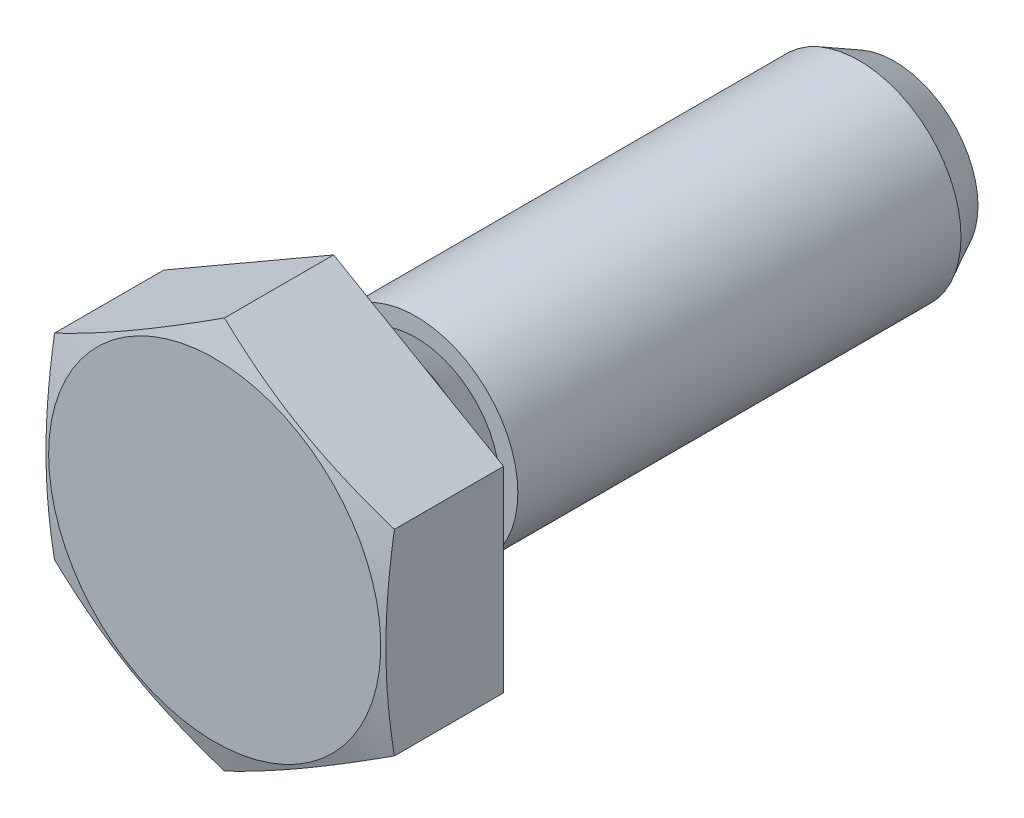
ISO-10303-21;
HEADER;
FILE_DESCRIPTION(('STEP AP214'),'2;1');
FILE_NAME('part.step','',(''),(''),'','','');
FILE_SCHEMA(('AUTOMOTIVE_DESIGN { 1 0 10303 214 1 1 1 1 }'));
ENDSEC;
DATA;
#1=APPLICATION_CONTEXT('core data for automotive mechanical design processes');
#2=APPLICATION_PROTOCOL_DEFINITION('international standard','automotive_design',2000,#1);
#3=PRODUCT_CONTEXT('',#1,'mechanical');
#4=PRODUCT('Part','Part','',(#3));
#5=PRODUCT_RELATED_PRODUCT_CATEGORY('part','',(#4));
#6=PRODUCT_DEFINITION_FORMATION('','',#4);
#7=PRODUCT_DEFINITION_CONTEXT('part definition',#1,'design');
#8=PRODUCT_DEFINITION('design','',#6,#7);
#9=PRODUCT_DEFINITION_SHAPE('','',#8);
#10=(LENGTH_UNIT() NAMED_UNIT(*) SI_UNIT(.MILLI.,.METRE.));
#11=(NAMED_UNIT(*) PLANE_ANGLE_UNIT() SI_UNIT($,.RADIAN.));
#12=(NAMED_UNIT(*) SI_UNIT($,.STERADIAN.) SOLID_ANGLE_UNIT());
#13=UNCERTAINTY_MEASURE_WITH_UNIT(LENGTH_MEASURE(1.E-05),#10,'distance_accuracy_value','');
#14=(GEOMETRIC_REPRESENTATION_CONTEXT(3) GLOBAL_UNCERTAINTY_ASSIGNED_CONTEXT((#13)) GLOBAL_UNIT_ASSIGNED_CONTEXT((#10,
#11,#12)) REPRESENTATION_CONTEXT('',''));
#15=CARTESIAN_POINT('',(0.,0.,0.));
#16=DIRECTION('',(0.,0.,1.));
#17=DIRECTION('',(1.,0.,0.));
#18=AXIS2_PLACEMENT_3D('',#15,#16,#17);
#19=CARTESIAN_POINT('',(0.,0.,0.5));
#20=DIRECTION('',(0.,0.,1.));
#21=DIRECTION('',(1.,0.,0.));
#22=AXIS2_PLACEMENT_3D('',#19,#20,#21);
#23=TOROIDAL_SURFACE('',#22,3.94,0.5);
#24=CARTESIAN_POINT('',(0.,0.,0.5));
#25=DIRECTION('',(0.,0.,1.));
#26=DIRECTION('',(1.,0.,0.));
#27=AXIS2_PLACEMENT_3D('',#24,#25,#26);
#28=CIRCLE('',#27,4.44);
#29=CARTESIAN_POINT('',(4.44,0.,0.5));
#30=VERTEX_POINT('',#29);
#31=EDGE_CURVE('E10',#30,#30,#28,.T.);
#32=ORIENTED_EDGE('',*,*,#31,.F.);
#33=EDGE_LOOP('',(#32));
#34=FACE_BOUND('',#33,.T.);
#35=CARTESIAN_POINT('',(0.,0.,0.));
#36=DIRECTION('',(0.,0.,1.));
#37=DIRECTION('',(1.,0.,0.));
#38=AXIS2_PLACEMENT_3D('',#35,#36,#37);
#39=CIRCLE('',#38,3.94);
#40=CARTESIAN_POINT('',(3.94,0.,0.));
#41=VERTEX_POINT('',#40);
#42=EDGE_CURVE('E22',#41,#41,#39,.T.);
#43=ORIENTED_EDGE('',*,*,#42,.T.);
#44=EDGE_LOOP('',(#43));
#45=FACE_BOUND('',#44,.T.);
#46=ADVANCED_FACE('F15',(#34,#45),#23,.T.);
#47=CARTESIAN_POINT('',(0.,3.94,0.));
#48=DIRECTION('',(0.,0.,-1.));
#49=DIRECTION('',(-1.,0.,0.));
#50=AXIS2_PLACEMENT_3D('',#47,#48,#49);
#51=PLANE('',#50);
#52=CARTESIAN_POINT('',(0.,0.,0.));
#53=DIRECTION('',(0.,0.,1.));
#54=DIRECTION('',(1.,0.,0.));
#55=AXIS2_PLACEMENT_3D('',#52,#53,#54);
#56=CIRCLE('',#55,3.3);
#57=CARTESIAN_POINT('',(3.3,0.,0.));
#58=VERTEX_POINT('',#57);
#59=EDGE_CURVE('E116',#58,#58,#56,.T.);
#60=ORIENTED_EDGE('',*,*,#59,.T.);
#61=EDGE_LOOP('',(#60));
#62=FACE_BOUND('',#61,.T.);
#63=ORIENTED_EDGE('',*,*,#42,.F.);
#64=EDGE_LOOP('',(#63));
#65=FACE_BOUND('',#64,.T.);
#66=ADVANCED_FACE('F122',(#62,#65),#51,.T.);
#67=CARTESIAN_POINT('',(0.,0.,-0.3));
#68=DIRECTION('',(0.,0.,1.));
#69=DIRECTION('',(1.,0.,0.));
#70=AXIS2_PLACEMENT_3D('',#67,#68,#69);
#71=TOROIDAL_SURFACE('',#70,3.3,0.3);
#72=CARTESIAN_POINT('',(0.,0.,-0.3));
#73=DIRECTION('',(0.,0.,1.));
#74=DIRECTION('',(1.,0.,0.));
#75=AXIS2_PLACEMENT_3D('',#72,#73,#74);
#76=CIRCLE('',#75,3.);
#77=CARTESIAN_POINT('',(3.,0.,-0.3));
#78=VERTEX_POINT('',#77);
#79=EDGE_CURVE('E113',#78,#78,#76,.T.);
#80=ORIENTED_EDGE('',*,*,#79,.T.);
#81=EDGE_LOOP('',(#80));
#82=FACE_BOUND('',#81,.T.);
#83=ORIENTED_EDGE('',*,*,#59,.F.);
#84=EDGE_LOOP('',(#83));
#85=FACE_BOUND('',#84,.T.);
#86=ADVANCED_FACE('F124',(#82,#85),#71,.F.);
#87=CARTESIAN_POINT('',(0.,0.,0.5));
#88=DIRECTION('',(0.,0.,1.));
#89=DIRECTION('',(1.,0.,0.));
#90=AXIS2_PLACEMENT_3D('',#87,#88,#89);
#91=CYLINDRICAL_SURFACE('',#90,3.);
#92=CARTESIAN_POINT('',(0.,0.,-0.982527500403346));
#93=DIRECTION('',(0.,0.,1.));
#94=DIRECTION('',(1.,0.,0.));
#95=AXIS2_PLACEMENT_3D('',#92,#93,#94);
#96=CIRCLE('',#95,3.);
#97=CARTESIAN_POINT('',(3.,0.,-0.982527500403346));
#98=VERTEX_POINT('',#97);
#99=EDGE_CURVE('E110',#98,#98,#96,.T.);
#100=ORIENTED_EDGE('',*,*,#99,.T.);
#101=EDGE_LOOP('',(#100));
#102=FACE_BOUND('',#101,.T.);
#103=ORIENTED_EDGE('',*,*,#79,.F.);
#104=EDGE_LOOP('',(#103));
#105=FACE_BOUND('',#104,.T.);
#106=ADVANCED_FACE('F131',(#102,#105),#91,.T.);
#107=CARTESIAN_POINT('',(0.,0.,-0.982527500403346));
#108=DIRECTION('',(0.,0.,1.));
#109=DIRECTION('',(1.,0.,0.));
#110=AXIS2_PLACEMENT_3D('',#107,#108,#109);
#111=CONICAL_SURFACE('',#110,3.,0.523598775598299);
#112=CARTESIAN_POINT('',(0.,0.,-1.92));
#113=DIRECTION('',(0.,0.,1.));
#114=DIRECTION('',(1.,0.,0.));
#115=AXIS2_PLACEMENT_3D('',#112,#113,#114);
#116=CIRCLE('',#115,2.45875);
#117=CARTESIAN_POINT('',(2.45875,0.,-1.92));
#118=VERTEX_POINT('',#117);
#119=EDGE_CURVE('E107',#118,#118,#116,.T.);
#120=ORIENTED_EDGE('',*,*,#119,.T.);
#121=EDGE_LOOP('',(#120));
#122=FACE_BOUND('',#121,.T.);
#123=ORIENTED_EDGE('',*,*,#99,.F.);
#124=EDGE_LOOP('',(#123));
#125=FACE_BOUND('',#124,.T.);
#126=ADVANCED_FACE('F138',(#122,#125),#111,.T.);
#127=CARTESIAN_POINT('',(0.,2.45875,-1.92));
#128=DIRECTION('',(0.,0.,1.));
#129=DIRECTION('',(1.,0.,0.));
#130=AXIS2_PLACEMENT_3D('',#127,#128,#129);
#131=PLANE('',#130);
#132=CARTESIAN_POINT('',(0.,0.,-1.92));
#133=DIRECTION('',(0.,0.,1.));
#134=DIRECTION('',(1.,0.,0.));
#135=AXIS2_PLACEMENT_3D('',#132,#133,#134);
#136=CIRCLE('',#135,3.);
#137=CARTESIAN_POINT('',(3.,0.,-1.92));
#138=VERTEX_POINT('',#137);
#139=EDGE_CURVE('E104',#138,#138,#136,.T.);
#140=ORIENTED_EDGE('',*,*,#139,.T.);
#141=EDGE_LOOP('',(#140));
#142=FACE_BOUND('',#141,.T.);
#143=ORIENTED_EDGE('',*,*,#119,.F.);
#144=EDGE_LOOP('',(#143));
#145=FACE_BOUND('',#144,.T.);
#146=ADVANCED_FACE('F142',(#142,#145),#131,.T.);
#147=CARTESIAN_POINT('',(0.,0.,0.5));
#148=DIRECTION('',(0.,0.,1.));
#149=DIRECTION('',(1.,0.,0.));
#150=AXIS2_PLACEMENT_3D('',#147,#148,#149);
#151=CYLINDRICAL_SURFACE('',#150,3.);
#152=CARTESIAN_POINT('',(0.,0.,-14.95875));
#153=DIRECTION('',(0.,0.,1.));
#154=DIRECTION('',(1.,0.,0.));
#155=AXIS2_PLACEMENT_3D('',#152,#153,#154);
#156=CIRCLE('',#155,3.);
#157=CARTESIAN_POINT('',(3.,0.,-14.95875));
#158=VERTEX_POINT('',#157);
#159=EDGE_CURVE('E101',#158,#158,#156,.T.);
#160=ORIENTED_EDGE('',*,*,#159,.T.);
#161=EDGE_LOOP('',(#160));
#162=FACE_BOUND('',#161,.T.);
#163=ORIENTED_EDGE('',*,*,#139,.F.);
#164=EDGE_LOOP('',(#163));
#165=FACE_BOUND('',#164,.T.);
#166=ADVANCED_FACE('F146',(#162,#165),#151,.T.);
#167=CARTESIAN_POINT('',(0.,0.,-14.95875));
#168=DIRECTION('',(0.,0.,1.));
#169=DIRECTION('',(1.,0.,0.));
#170=AXIS2_PLACEMENT_3D('',#167,#168,#169);
#171=CONICAL_SURFACE('',#170,3.,0.479368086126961);
#172=CARTESIAN_POINT('',(0.,0.,-16.));
#173=DIRECTION('',(0.,0.,1.));
#174=DIRECTION('',(1.,0.,0.));
#175=AXIS2_PLACEMENT_3D('',#172,#173,#174);
#176=CIRCLE('',#175,2.45875);
#177=CARTESIAN_POINT('',(2.45875,0.,-16.));
#178=VERTEX_POINT('',#177);
#179=EDGE_CURVE('E98',#178,#178,#176,.T.);
#180=ORIENTED_EDGE('',*,*,#179,.T.);
#181=EDGE_LOOP('',(#180));
#182=FACE_BOUND('',#181,.T.);
#183=ORIENTED_EDGE('',*,*,#159,.F.);
#184=EDGE_LOOP('',(#183));
#185=FACE_BOUND('',#184,.T.);
#186=ADVANCED_FACE('F150',(#182,#185),#171,.T.);
#187=CARTESIAN_POINT('',(0.,2.45875,-16.));
#188=DIRECTION('',(0.,0.,-1.));
#189=DIRECTION('',(-1.,0.,0.));
#190=AXIS2_PLACEMENT_3D('',#187,#188,#189);
#191=PLANE('',#190);
#192=ORIENTED_EDGE('',*,*,#179,.F.);
#193=EDGE_LOOP('',(#192));
#194=FACE_BOUND('',#193,.T.);
#195=ADVANCED_FACE('F154',(#194),#191,.T.);
#196=CARTESIAN_POINT('',(-5.,-2.88675,0.5));
#197=DIRECTION('',(0.,0.,-1.));
#198=DIRECTION('',(-1.,0.,0.));
#199=AXIS2_PLACEMENT_3D('',#196,#197,#198);
#200=PLANE('',#199);
#201=DIRECTION('',(0.,-1.,0.));
#202=VECTOR('',#201,1.);
#203=CARTESIAN_POINT('',(-5.,2.88675,0.5));
#204=LINE('',#203,#202);
#205=CARTESIAN_POINT('',(-5.,2.88675,0.5));
#206=VERTEX_POINT('',#205);
#207=CARTESIAN_POINT('',(-5.,-2.88675,0.5));
#208=VERTEX_POINT('',#207);
#209=EDGE_CURVE('E81',#206,#208,#204,.T.);
#210=ORIENTED_EDGE('',*,*,#209,.F.);
#211=DIRECTION('',(0.866025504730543,0.499999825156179,0.));
#212=VECTOR('',#211,1.);
#213=CARTESIAN_POINT('',(-5.,2.88675,0.5));
#214=LINE('',#213,#212);
#215=CARTESIAN_POINT('',(0.,5.7735,0.5));
#216=VERTEX_POINT('',#215);
#217=EDGE_CURVE('E86',#206,#216,#214,.T.);
#218=ORIENTED_EDGE('',*,*,#217,.T.);
#219=DIRECTION('',(0.866025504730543,-0.499999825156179,0.));
#220=VECTOR('',#219,1.);
#221=CARTESIAN_POINT('',(0.,5.7735,0.5));
#222=LINE('',#221,#220);
#223=CARTESIAN_POINT('',(5.,2.88675,0.5));
#224=VERTEX_POINT('',#223);
#225=EDGE_CURVE('E92',#216,#224,#222,.T.);
#226=ORIENTED_EDGE('',*,*,#225,.T.);
#227=DIRECTION('',(0.,-1.,0.));
#228=VECTOR('',#227,1.);
#229=CARTESIAN_POINT('',(5.,2.88675,0.5));
#230=LINE('',#229,#228);
#231=CARTESIAN_POINT('',(5.,-2.88675,0.5));
#232=VERTEX_POINT('',#231);
#233=EDGE_CURVE('E244',#224,#232,#230,.T.);
#234=ORIENTED_EDGE('',*,*,#233,.T.);
#235=DIRECTION('',(-0.866025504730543,-0.499999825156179,0.));
#236=VECTOR('',#235,1.);
#237=CARTESIAN_POINT('',(5.,-2.88675,0.5));
#238=LINE('',#237,#236);
#239=CARTESIAN_POINT('',(0.,-5.7735,0.5));
#240=VERTEX_POINT('',#239);
#241=EDGE_CURVE('E230',#232,#240,#238,.T.);
#242=ORIENTED_EDGE('',*,*,#241,.T.);
#243=DIRECTION('',(-0.866025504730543,0.499999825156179,0.));
#244=VECTOR('',#243,1.);
#245=CARTESIAN_POINT('',(0.,-5.7735,0.5));
#246=LINE('',#245,#244);
#247=EDGE_CURVE('E228',#240,#208,#246,.T.);
#248=ORIENTED_EDGE('',*,*,#247,.T.);
#249=EDGE_LOOP('',(#210,#218,#226,#234,#242,#248));
#250=FACE_BOUND('',#249,.T.);
#251=ORIENTED_EDGE('',*,*,#31,.T.);
#252=EDGE_LOOP('',(#251));
#253=FACE_BOUND('',#252,.T.);
#254=ADVANCED_FACE('F158',(#250,#253),#200,.T.);
#255=CARTESIAN_POINT('',(-5.,2.88675,0.5));
#256=DIRECTION('',(-1.,0.,0.));
#257=DIRECTION('',(0.,0.,1.));
#258=AXIS2_PLACEMENT_3D('',#255,#256,#257);
#259=PLANE('',#258);
#260=CARTESIAN_POINT('',(-5.,3.41675832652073,3.62147932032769));
#261=CARTESIAN_POINT('',(-5.,3.18521449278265,3.66374586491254));
#262=CARTESIAN_POINT('',(-5.,2.95311617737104,3.70321492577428));
#263=CARTESIAN_POINT('',(-5.,2.48772048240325,3.77520976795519));
#264=CARTESIAN_POINT('',(-5.,2.25442251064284,3.80773169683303));
#265=CARTESIAN_POINT('',(-5.,1.7870025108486,3.86440884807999));
#266=CARTESIAN_POINT('',(-5.,1.55288140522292,3.88857151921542));
#267=CARTESIAN_POINT('',(-5.,1.08387721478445,3.92726925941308));
#268=CARTESIAN_POINT('',(-5.,0.848994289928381,3.94180623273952));
#269=CARTESIAN_POINT('',(-5.,0.382139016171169,3.96021768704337));
#270=CARTESIAN_POINT('',(-5.,0.150172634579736,3.96424046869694));
#271=CARTESIAN_POINT('',(-5.,-0.313714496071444,3.96178586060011));
#272=CARTESIAN_POINT('',(-5.,-0.545635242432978,3.95530797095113));
#273=CARTESIAN_POINT('',(-5.,-1.0088963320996,3.93227848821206));
#274=CARTESIAN_POINT('',(-5.,-1.24023682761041,3.91572989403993));
#275=CARTESIAN_POINT('',(-5.,-1.70207710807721,3.8735414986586));
#276=CARTESIAN_POINT('',(-5.,-1.9325768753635,3.84790150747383));
#277=CARTESIAN_POINT('',(-5.,-2.39244352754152,3.78882004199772));
#278=CARTESIAN_POINT('',(-5.,-2.62181091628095,3.75538243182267));
#279=CARTESIAN_POINT('',(-5.,-3.07949423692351,3.68201701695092));
#280=CARTESIAN_POINT('',(-5.,-3.30781016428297,3.64208918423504));
#281=CARTESIAN_POINT('',(-5.,-3.76361168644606,3.55691732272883));
#282=CARTESIAN_POINT('',(-5.,-3.99109655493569,3.51166944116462));
#283=CARTESIAN_POINT('',(-5.,-4.4451770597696,3.41690513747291));
#284=CARTESIAN_POINT('',(-5.,-4.6717726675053,3.36738857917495));
#285=CARTESIAN_POINT('',(-5.,-5.12792425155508,3.26407751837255));
#286=CARTESIAN_POINT('',(-5.,-5.35746720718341,3.21022580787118));
#287=CARTESIAN_POINT('',(-5.,-5.8158666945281,3.09967387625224));
#288=CARTESIAN_POINT('',(-5.,-6.04472321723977,3.04297361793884));
#289=CARTESIAN_POINT('',(-5.,-6.5013747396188,2.92739984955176));
#290=CARTESIAN_POINT('',(-5.,-6.72917095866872,2.86853114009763));
#291=CARTESIAN_POINT('',(-5.,-7.18425622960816,2.748920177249));
#292=CARTESIAN_POINT('',(-5.,-7.41154531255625,2.68817804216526));
#293=CARTESIAN_POINT('',(-5.,-7.63863176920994,2.62670107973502));
#294=B_SPLINE_CURVE_WITH_KNOTS('',3,(#260,#261,#262,#263,#264,#265,#266,#267,#268,#269,#270,
#271,#272,#273,#274,#275,#276,#277,#278,#279,#280,#281,#282,#283,#284,#285,#286,#287,#288,#289,
#290,#291,#292,#293),.UNSPECIFIED.,.F.,.F.,(4,2,2,2,2,2,2,2,2,2,2,2,2,2,2,2,4),(0.,
0.706157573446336,1.41270572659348,2.11862265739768,2.82439989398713,3.52016717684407,
4.21596758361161,4.9115608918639,5.60716873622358,6.3024326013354,6.99769946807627,
7.69347298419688,8.38926870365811,9.09657212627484,9.80388478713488,10.5097159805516,
11.2155026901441),.UNSPECIFIED.);
#295=CARTESIAN_POINT('',(-5.,2.88675,3.71288574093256));
#296=VERTEX_POINT('',#295);
#297=CARTESIAN_POINT('',(-5.,-2.88675,3.71288574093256));
#298=VERTEX_POINT('',#297);
#299=EDGE_CURVE('E70',#296,#298,#294,.T.);
#300=ORIENTED_EDGE('',*,*,#299,.F.);
#301=DIRECTION('',(0.,0.,1.));
#302=VECTOR('',#301,1.);
#303=CARTESIAN_POINT('',(-5.,2.88675,0.5));
#304=LINE('',#303,#302);
#305=EDGE_CURVE('E79',#206,#296,#304,.T.);
#306=ORIENTED_EDGE('',*,*,#305,.F.);
#307=ORIENTED_EDGE('',*,*,#209,.T.);
#308=DIRECTION('',(0.,0.,1.));
#309=VECTOR('',#308,1.);
#310=CARTESIAN_POINT('',(-5.,-2.88675,0.5));
#311=LINE('',#310,#309);
#312=EDGE_CURVE('E37',#208,#298,#311,.T.);
#313=ORIENTED_EDGE('',*,*,#312,.T.);
#314=EDGE_LOOP('',(#300,#306,#307,#313));
#315=FACE_BOUND('',#314,.T.);
#316=ADVANCED_FACE('F77',(#315),#259,.T.);
#317=CARTESIAN_POINT('',(0.,-5.7735,0.5));
#318=DIRECTION('',(0.499999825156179,0.866025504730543,0.));
#319=DIRECTION('',(0.866025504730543,-0.499999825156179,0.));
#320=AXIS2_PLACEMENT_3D('',#317,#318,#319);
#321=PLANE('',#320);
#322=DIRECTION('',(0.,0.,1.));
#323=VECTOR('',#322,1.);
#324=CARTESIAN_POINT('',(0.,-5.7735,0.5));
#325=LINE('',#324,#323);
#326=CARTESIAN_POINT('',(0.,-5.7735,3.71288639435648));
#327=VERTEX_POINT('',#326);
#328=EDGE_CURVE('E235',#240,#327,#325,.T.);
#329=ORIENTED_EDGE('',*,*,#328,.T.);
#330=CARTESIAN_POINT('',(1.99999999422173E-07,-5.77350011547,3.71288635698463));
#331=CARTESIAN_POINT('',(-0.207322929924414,-5.65380210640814,3.75164026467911));
#332=CARTESIAN_POINT('',(-0.41519017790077,-5.53378995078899,3.78686112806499));
#333=CARTESIAN_POINT('',(-0.831994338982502,-5.29314806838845,3.84878739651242));
#334=CARTESIAN_POINT('',(-1.04093182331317,-5.17251801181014,3.87548763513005));
#335=CARTESIAN_POINT('',(-1.45803647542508,-4.93170264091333,3.91871011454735));
#336=CARTESIAN_POINT('',(-1.66619766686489,-4.81152077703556,3.93530719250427));
#337=CARTESIAN_POINT('',(-2.08290600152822,-4.57093422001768,3.95756562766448));
#338=CARTESIAN_POINT('',(-2.29145301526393,-4.45052960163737,3.9632301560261));
#339=CARTESIAN_POINT('',(-2.7085470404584,-4.20972036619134,3.96323009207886));
#340=CARTESIAN_POINT('',(-2.91709405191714,-4.08931574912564,3.95756549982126));
#341=CARTESIAN_POINT('',(-3.3338023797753,-3.84872919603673,3.93530694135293));
#342=CARTESIAN_POINT('',(-3.54196356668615,-3.72854733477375,3.91870980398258));
#343=CARTESIAN_POINT('',(-3.95906820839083,-3.48773196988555,3.87548721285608));
#344=CARTESIAN_POINT('',(-4.16800568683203,-3.36710191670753,3.84878692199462));
#345=CARTESIAN_POINT('',(-4.58480983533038,-3.126460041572,3.78686055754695));
#346=CARTESIAN_POINT('',(-4.79267707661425,-3.00644788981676,3.75163965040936));
#347=CARTESIAN_POINT('',(-5.0000002,-2.88674988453,3.71288570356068));
#348=B_SPLINE_CURVE_WITH_KNOTS('',3,(#330,#331,#332,#333,#334,#335,#336,#337,#338,#339,#340,
#341,#342,#343,#344,#345,#346,#347),.UNSPECIFIED.,.F.,.F.,(4,2,2,2,2,2,2,2,4),(0.,
0.727595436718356,1.45563121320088,2.17820641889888,2.90057199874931,3.62293757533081,
4.34551277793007,5.07354855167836,5.80114398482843),.UNSPECIFIED.);
#349=EDGE_CURVE('E82',#327,#298,#348,.T.);
#350=ORIENTED_EDGE('',*,*,#349,.T.);
#351=ORIENTED_EDGE('',*,*,#312,.F.);
#352=ORIENTED_EDGE('',*,*,#247,.F.);
#353=EDGE_LOOP('',(#329,#350,#351,#352));
#354=FACE_BOUND('',#353,.T.);
#355=ADVANCED_FACE('F163',(#354),#321,.F.);
#356=CARTESIAN_POINT('',(5.,-2.88675,0.5));
#357=DIRECTION('',(-0.499999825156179,0.866025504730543,0.));
#358=DIRECTION('',(0.866025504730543,0.499999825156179,0.));
#359=AXIS2_PLACEMENT_3D('',#356,#357,#358);
#360=PLANE('',#359);
#361=DIRECTION('',(0.,0.,1.));
#362=VECTOR('',#361,1.);
#363=CARTESIAN_POINT('',(5.,-2.88675,0.5));
#364=LINE('',#363,#362);
#365=CARTESIAN_POINT('',(5.,-2.88675,3.71288574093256));
#366=VERTEX_POINT('',#365);
#367=EDGE_CURVE('E238',#232,#366,#364,.T.);
#368=ORIENTED_EDGE('',*,*,#367,.T.);
#369=CARTESIAN_POINT('',(5.0000002,-2.88674988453,3.71288570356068));
#370=CARTESIAN_POINT('',(4.79267707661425,-3.00644788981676,3.75163965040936));
#371=CARTESIAN_POINT('',(4.58480983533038,-3.126460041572,3.78686055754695));
#372=CARTESIAN_POINT('',(4.16800568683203,-3.36710191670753,3.84878692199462));
#373=CARTESIAN_POINT('',(3.95906820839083,-3.48773196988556,3.87548721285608));
#374=CARTESIAN_POINT('',(3.54196356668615,-3.72854733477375,3.91870980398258));
#375=CARTESIAN_POINT('',(3.3338023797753,-3.84872919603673,3.93530694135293));
#376=CARTESIAN_POINT('',(2.91709405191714,-4.08931574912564,3.95756549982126));
#377=CARTESIAN_POINT('',(2.7085470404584,-4.20972036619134,3.96323009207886));
#378=CARTESIAN_POINT('',(2.29145301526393,-4.45052960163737,3.9632301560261));
#379=CARTESIAN_POINT('',(2.08290600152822,-4.57093422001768,3.95756562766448));
#380=CARTESIAN_POINT('',(1.66619766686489,-4.81152077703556,3.93530719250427));
#381=CARTESIAN_POINT('',(1.45803647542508,-4.93170264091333,3.91871011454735));
#382=CARTESIAN_POINT('',(1.04093182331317,-5.17251801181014,3.87548763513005));
#383=CARTESIAN_POINT('',(0.831994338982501,-5.29314806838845,3.84878739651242));
#384=CARTESIAN_POINT('',(0.415190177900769,-5.53378995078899,3.78686112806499));
#385=CARTESIAN_POINT('',(0.207322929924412,-5.65380210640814,3.75164026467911));
#386=CARTESIAN_POINT('',(-2.00000001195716E-07,-5.77350011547,3.71288635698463));
#387=B_SPLINE_CURVE_WITH_KNOTS('',3,(#369,#370,#371,#372,#373,#374,#375,#376,#377,#378,#379,
#380,#381,#382,#383,#384,#385,#386),.UNSPECIFIED.,.F.,.F.,(4,2,2,2,2,2,2,2,4),(0.,
0.727595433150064,1.45563120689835,2.17820640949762,2.90057198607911,3.62293756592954,
4.34551277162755,5.07354854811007,5.80114398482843),.UNSPECIFIED.);
#388=EDGE_CURVE('E201',#366,#327,#387,.T.);
#389=ORIENTED_EDGE('',*,*,#388,.T.);
#390=ORIENTED_EDGE('',*,*,#328,.F.);
#391=ORIENTED_EDGE('',*,*,#241,.F.);
#392=EDGE_LOOP('',(#368,#389,#390,#391));
#393=FACE_BOUND('',#392,.T.);
#394=ADVANCED_FACE('F206',(#393),#360,.F.);
#395=CARTESIAN_POINT('',(5.,2.88675,0.5));
#396=DIRECTION('',(-1.,0.,0.));
#397=DIRECTION('',(0.,0.,1.));
#398=AXIS2_PLACEMENT_3D('',#395,#396,#397);
#399=PLANE('',#398);
#400=DIRECTION('',(0.,0.,1.));
#401=VECTOR('',#400,1.);
#402=CARTESIAN_POINT('',(5.,2.88675,0.5));
#403=LINE('',#402,#401);
#404=CARTESIAN_POINT('',(5.,2.88675,3.71288574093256));
#405=VERTEX_POINT('',#404);
#406=EDGE_CURVE('E90',#224,#405,#403,.T.);
#407=ORIENTED_EDGE('',*,*,#406,.T.);
#408=CARTESIAN_POINT('',(5.,3.41675832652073,3.62147932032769));
#409=CARTESIAN_POINT('',(5.,3.18521449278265,3.66374586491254));
#410=CARTESIAN_POINT('',(5.,2.95311617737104,3.70321492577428));
#411=CARTESIAN_POINT('',(5.,2.48772048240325,3.77520976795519));
#412=CARTESIAN_POINT('',(5.,2.25442251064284,3.80773169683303));
#413=CARTESIAN_POINT('',(5.,1.7870025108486,3.86440884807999));
#414=CARTESIAN_POINT('',(5.,1.55288140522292,3.88857151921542));
#415=CARTESIAN_POINT('',(5.,1.08387721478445,3.92726925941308));
#416=CARTESIAN_POINT('',(5.,0.848994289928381,3.94180623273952));
#417=CARTESIAN_POINT('',(5.,0.382139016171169,3.96021768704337));
#418=CARTESIAN_POINT('',(5.,0.150172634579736,3.96424046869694));
#419=CARTESIAN_POINT('',(5.,-0.313714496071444,3.96178586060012));
#420=CARTESIAN_POINT('',(5.,-0.545635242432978,3.95530797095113));
#421=CARTESIAN_POINT('',(5.,-1.0088963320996,3.93227848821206));
#422=CARTESIAN_POINT('',(5.,-1.24023682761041,3.91572989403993));
#423=CARTESIAN_POINT('',(5.,-1.70207710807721,3.8735414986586));
#424=CARTESIAN_POINT('',(5.,-1.9325768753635,3.84790150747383));
#425=CARTESIAN_POINT('',(5.,-2.39244352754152,3.78882004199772));
#426=CARTESIAN_POINT('',(5.,-2.62181091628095,3.75538243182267));
#427=CARTESIAN_POINT('',(5.,-3.07949423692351,3.68201701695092));
#428=CARTESIAN_POINT('',(5.,-3.30781016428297,3.64208918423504));
#429=CARTESIAN_POINT('',(5.,-3.76361168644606,3.55691732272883));
#430=CARTESIAN_POINT('',(5.,-3.99109655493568,3.51166944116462));
#431=CARTESIAN_POINT('',(5.,-4.4451770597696,3.41690513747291));
#432=CARTESIAN_POINT('',(5.,-4.6717726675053,3.36738857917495));
#433=CARTESIAN_POINT('',(5.,-5.12792425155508,3.26407751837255));
#434=CARTESIAN_POINT('',(5.,-5.35746720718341,3.21022580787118));
#435=CARTESIAN_POINT('',(5.,-5.8158666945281,3.09967387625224));
#436=CARTESIAN_POINT('',(5.,-6.04472321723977,3.04297361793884));
#437=CARTESIAN_POINT('',(5.,-6.5013747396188,2.92739984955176));
#438=CARTESIAN_POINT('',(5.,-6.72917095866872,2.86853114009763));
#439=CARTESIAN_POINT('',(5.,-7.18425622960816,2.748920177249));
#440=CARTESIAN_POINT('',(5.,-7.41154531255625,2.68817804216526));
#441=CARTESIAN_POINT('',(5.,-7.63863176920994,2.62670107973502));
#442=B_SPLINE_CURVE_WITH_KNOTS('',3,(#408,#409,#410,#411,#412,#413,#414,#415,#416,#417,#418,
#419,#420,#421,#422,#423,#424,#425,#426,#427,#428,#429,#430,#431,#432,#433,#434,#435,#436,#437,
#438,#439,#440,#441),.UNSPECIFIED.,.F.,.F.,(4,2,2,2,2,2,2,2,2,2,2,2,2,2,2,2,4),(0.,
0.706157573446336,1.41270572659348,2.11862265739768,2.82439989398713,3.52016717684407,
4.21596758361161,4.9115608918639,5.60716873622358,6.3024326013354,6.99769946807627,
7.69347298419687,8.38926870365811,9.09657212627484,9.80388478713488,10.5097159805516,
11.2155026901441),.UNSPECIFIED.);
#443=EDGE_CURVE('E196',#405,#366,#442,.T.);
#444=ORIENTED_EDGE('',*,*,#443,.T.);
#445=ORIENTED_EDGE('',*,*,#367,.F.);
#446=ORIENTED_EDGE('',*,*,#233,.F.);
#447=EDGE_LOOP('',(#407,#444,#445,#446));
#448=FACE_BOUND('',#447,.T.);
#449=ADVANCED_FACE('F209',(#448),#399,.F.);
#450=CARTESIAN_POINT('',(0.,5.7735,0.5));
#451=DIRECTION('',(-0.499999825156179,-0.866025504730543,0.));
#452=DIRECTION('',(-0.866025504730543,0.499999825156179,0.));
#453=AXIS2_PLACEMENT_3D('',#450,#451,#452);
#454=PLANE('',#453);
#455=DIRECTION('',(0.,0.,1.));
#456=VECTOR('',#455,1.);
#457=CARTESIAN_POINT('',(0.,5.7735,0.5));
#458=LINE('',#457,#456);
#459=CARTESIAN_POINT('',(0.,5.7735,3.71288639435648));
#460=VERTEX_POINT('',#459);
#461=EDGE_CURVE('E88',#216,#460,#458,.T.);
#462=ORIENTED_EDGE('',*,*,#461,.T.);
#463=CARTESIAN_POINT('',(-1.99999999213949E-07,5.77350011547,3.71288635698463));
#464=CARTESIAN_POINT('',(0.207322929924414,5.65380210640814,3.75164026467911));
#465=CARTESIAN_POINT('',(0.41519017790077,5.53378995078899,3.78686112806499));
#466=CARTESIAN_POINT('',(0.831994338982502,5.29314806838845,3.84878739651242));
#467=CARTESIAN_POINT('',(1.04093182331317,5.17251801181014,3.87548763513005));
#468=CARTESIAN_POINT('',(1.45803647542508,4.93170264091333,3.91871011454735));
#469=CARTESIAN_POINT('',(1.66619766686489,4.81152077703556,3.93530719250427));
#470=CARTESIAN_POINT('',(2.08290600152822,4.57093422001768,3.95756562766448));
#471=CARTESIAN_POINT('',(2.29145301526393,4.45052960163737,3.9632301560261));
#472=CARTESIAN_POINT('',(2.7085470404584,4.20972036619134,3.96323009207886));
#473=CARTESIAN_POINT('',(2.91709405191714,4.08931574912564,3.95756549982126));
#474=CARTESIAN_POINT('',(3.3338023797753,3.84872919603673,3.93530694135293));
#475=CARTESIAN_POINT('',(3.54196356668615,3.72854733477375,3.91870980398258));
#476=CARTESIAN_POINT('',(3.95906820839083,3.48773196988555,3.87548721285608));
#477=CARTESIAN_POINT('',(4.16800568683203,3.36710191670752,3.84878692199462));
#478=CARTESIAN_POINT('',(4.58480983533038,3.126460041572,3.78686055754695));
#479=CARTESIAN_POINT('',(4.79267707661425,3.00644788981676,3.75163965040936));
#480=CARTESIAN_POINT('',(5.0000002,2.88674988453,3.71288570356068));
#481=B_SPLINE_CURVE_WITH_KNOTS('',3,(#463,#464,#465,#466,#467,#468,#469,#470,#471,#472,#473,
#474,#475,#476,#477,#478,#479,#480),.UNSPECIFIED.,.F.,.F.,(4,2,2,2,2,2,2,2,4),(0.,
0.727595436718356,1.45563121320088,2.17820641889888,2.90057199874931,3.62293757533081,
4.34551277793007,5.07354855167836,5.80114398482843),.UNSPECIFIED.);
#482=EDGE_CURVE('E29',#460,#405,#481,.T.);
#483=ORIENTED_EDGE('',*,*,#482,.T.);
#484=ORIENTED_EDGE('',*,*,#406,.F.);
#485=ORIENTED_EDGE('',*,*,#225,.F.);
#486=EDGE_LOOP('',(#462,#483,#484,#485));
#487=FACE_BOUND('',#486,.T.);
#488=ADVANCED_FACE('F213',(#487),#454,.F.);
#489=CARTESIAN_POINT('',(-5.,2.88675,0.5));
#490=DIRECTION('',(0.499999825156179,-0.866025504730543,0.));
#491=DIRECTION('',(-0.866025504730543,-0.499999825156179,0.));
#492=AXIS2_PLACEMENT_3D('',#489,#490,#491);
#493=PLANE('',#492);
#494=ORIENTED_EDGE('',*,*,#305,.T.);
#495=CARTESIAN_POINT('',(-5.0000002,2.88674988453,3.71288570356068));
#496=CARTESIAN_POINT('',(-4.79267707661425,3.00644788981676,3.75163965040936));
#497=CARTESIAN_POINT('',(-4.58480983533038,3.126460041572,3.78686055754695));
#498=CARTESIAN_POINT('',(-4.16800568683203,3.36710191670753,3.84878692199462));
#499=CARTESIAN_POINT('',(-3.95906820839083,3.48773196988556,3.87548721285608));
#500=CARTESIAN_POINT('',(-3.54196356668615,3.72854733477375,3.91870980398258));
#501=CARTESIAN_POINT('',(-3.3338023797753,3.84872919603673,3.93530694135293));
#502=CARTESIAN_POINT('',(-2.91709405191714,4.08931574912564,3.95756549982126));
#503=CARTESIAN_POINT('',(-2.7085470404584,4.20972036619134,3.96323009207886));
#504=CARTESIAN_POINT('',(-2.29145301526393,4.45052960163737,3.9632301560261));
#505=CARTESIAN_POINT('',(-2.08290600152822,4.57093422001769,3.95756562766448));
#506=CARTESIAN_POINT('',(-1.66619766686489,4.81152077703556,3.93530719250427));
#507=CARTESIAN_POINT('',(-1.45803647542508,4.93170264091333,3.91871011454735));
#508=CARTESIAN_POINT('',(-1.04093182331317,5.17251801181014,3.87548763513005));
#509=CARTESIAN_POINT('',(-0.831994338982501,5.29314806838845,3.84878739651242));
#510=CARTESIAN_POINT('',(-0.415190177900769,5.53378995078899,3.78686112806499));
#511=CARTESIAN_POINT('',(-0.207322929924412,5.65380210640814,3.75164026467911));
#512=CARTESIAN_POINT('',(2.00000002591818E-07,5.77350011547,3.71288635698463));
#513=B_SPLINE_CURVE_WITH_KNOTS('',3,(#495,#496,#497,#498,#499,#500,#501,#502,#503,#504,#505,
#506,#507,#508,#509,#510,#511,#512),.UNSPECIFIED.,.F.,.F.,(4,2,2,2,2,2,2,2,4),(0.,
0.727595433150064,1.45563120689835,2.17820640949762,2.90057198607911,3.62293756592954,
4.34551277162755,5.07354854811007,5.80114398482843),.UNSPECIFIED.);
#514=EDGE_CURVE('E66',#296,#460,#513,.T.);
#515=ORIENTED_EDGE('',*,*,#514,.T.);
#516=ORIENTED_EDGE('',*,*,#461,.F.);
#517=ORIENTED_EDGE('',*,*,#217,.F.);
#518=EDGE_LOOP('',(#494,#515,#516,#517));
#519=FACE_BOUND('',#518,.T.);
#520=ADVANCED_FACE('F84',(#519),#493,.F.);
#521=CARTESIAN_POINT('',(0.,0.,3.67551454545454));
#522=DIRECTION('',(0.,0.,-1.));
#523=DIRECTION('',(-1.,0.,0.));
#524=AXIS2_PLACEMENT_3D('',#521,#522,#523);
#525=CONICAL_SURFACE('',#524,5.88897,1.25778607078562);
#526=ORIENTED_EDGE('',*,*,#299,.T.);
#527=ORIENTED_EDGE('',*,*,#349,.F.);
#528=ORIENTED_EDGE('',*,*,#388,.F.);
#529=ORIENTED_EDGE('',*,*,#443,.F.);
#530=ORIENTED_EDGE('',*,*,#482,.F.);
#531=ORIENTED_EDGE('',*,*,#514,.F.);
#532=EDGE_LOOP('',(#526,#527,#528,#529,#530,#531));
#533=FACE_BOUND('',#532,.T.);
#534=CARTESIAN_POINT('',(0.,0.,4.));
#535=DIRECTION('',(0.,0.,-1.));
#536=DIRECTION('',(-1.,0.,0.));
#537=AXIS2_PLACEMENT_3D('',#534,#535,#536);
#538=CIRCLE('',#537,4.88638820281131);
#539=CARTESIAN_POINT('',(-4.88638820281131,0.,4.));
#540=VERTEX_POINT('',#539);
#541=EDGE_CURVE('E74',#540,#540,#538,.F.);
#542=ORIENTED_EDGE('',*,*,#541,.F.);
#543=EDGE_LOOP('',(#542));
#544=FACE_BOUND('',#543,.T.);
#545=ADVANCED_FACE('F68',(#533,#544),#525,.T.);
#546=CARTESIAN_POINT('',(-5.,-2.88675,4.));
#547=DIRECTION('',(0.,0.,-1.));
#548=DIRECTION('',(-1.,0.,0.));
#549=AXIS2_PLACEMENT_3D('',#546,#547,#548);
#550=PLANE('',#549);
#551=ORIENTED_EDGE('',*,*,#541,.T.);
#552=EDGE_LOOP('',(#551));
#553=FACE_BOUND('',#552,.T.);
#554=ADVANCED_FACE('F179',(#553),#550,.F.);
#555=CLOSED_SHELL('',(#46,#66,#86,#106,#126,#146,#166,#186,#195,#254,#316,#355,#394,#449,#488,
#520,#545,#554));
#556=MANIFOLD_SOLID_BREP('B1',#555);
#557=ADVANCED_BREP_SHAPE_REPRESENTATION('',(#18,#556),#14);
#558=SHAPE_DEFINITION_REPRESENTATION(#9,#557);
ENDSEC;
END-ISO-10303-21;
